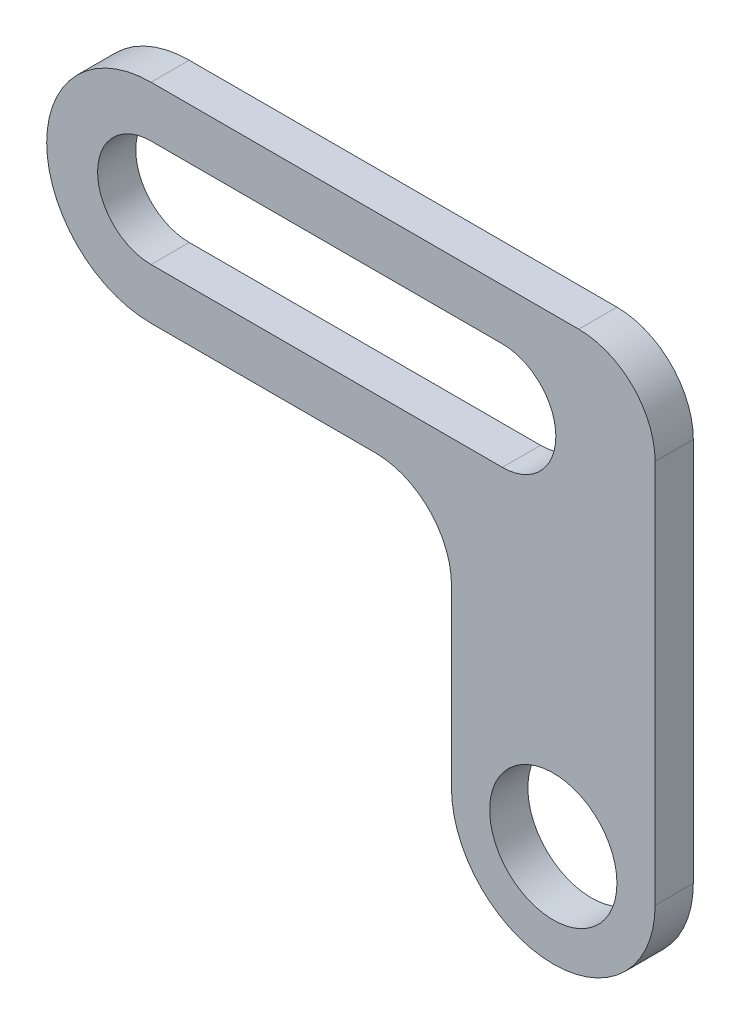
from build123d import *

# Parameters (mm, degrees)
ESQUISSE1_R        = 25
BOSS_EXTRU_1_DEPTH = 15
CONG_1_R           = 30


with BuildPart() as part:
    # Esquisse1 → Boss.-Extru.1 (new body)
    with BuildSketch(Plane.XY):
        with BuildLine():
            Line((40, 0), (40, 181))
            Line((40, 181), (-158, 181))
            ThreePointArc((-158, 181), (-199, 140), (-158, 99))
            Line((-158, 99), (-40, 99))
            Line((-40, 99), (-40, 0))
            ThreePointArc((-40, 0), (0, -40), (40, 0))
        make_face()
        Circle(ESQUISSE1_R, mode=Mode.SUBTRACT)
        with BuildLine():
            Line((-158, 161), (-20, 161))
            ThreePointArc((-20, 161), (1, 140), (-20, 119))
            Line((-20, 119), (-158, 119))
            ThreePointArc((-158, 119), (-179, 140), (-158, 161))
        make_face(mode=Mode.SUBTRACT)
    extrude(amount=BOSS_EXTRU_1_DEPTH)

    # Cong_1
    cong_1_edges = [part.edges().sort_by_distance(p)[0] for p in [
        (-40, 99, 7.5),
        (40, 181, 7.5),
    ]]
    fillet(cong_1_edges, radius=CONG_1_R)


solid = part.part
